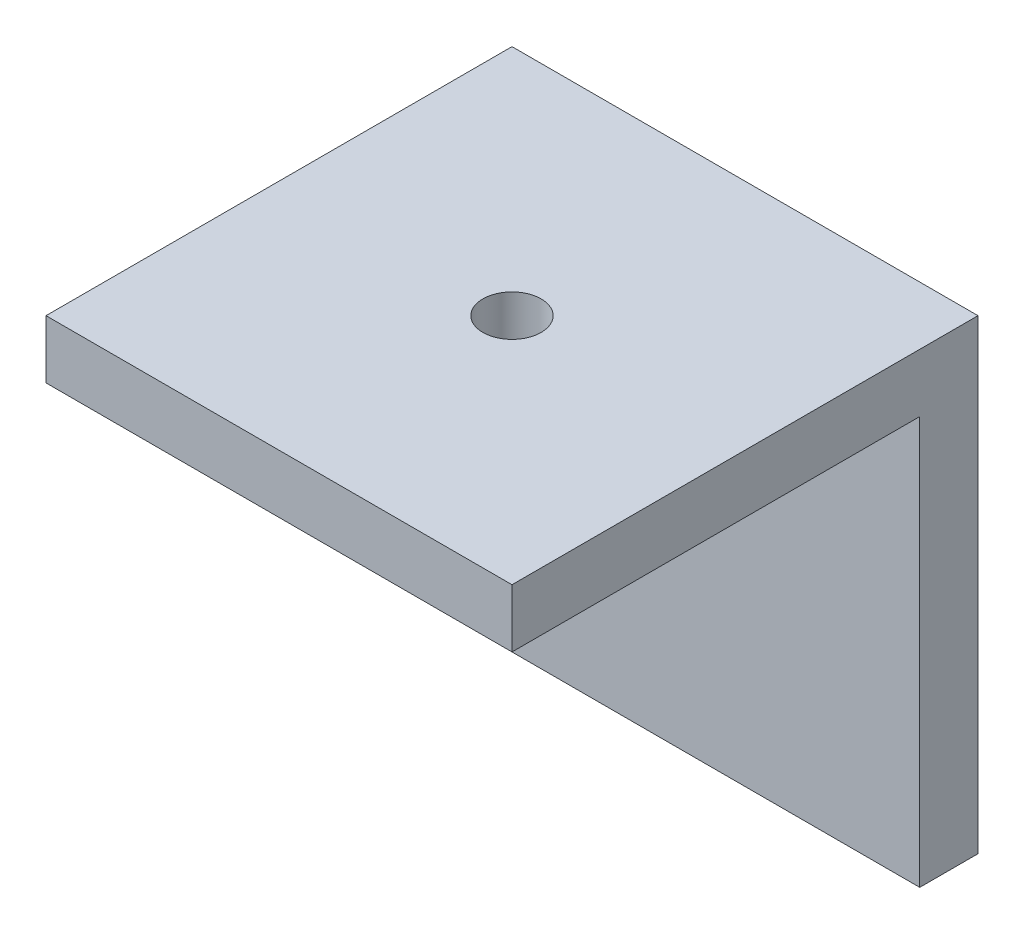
from build123d import *

# Parameters (mm, degrees)
SKETCH_2_W          = 25.4
SKETCH_2_H          = 25.4
SKETCH_2_R          = 1.5875
EXTRUDE_1_DEPTH     = 3.175
SKETCH_3_W          = 25.4
SKETCH_3_H          = 3.175
EXTRUDE_2_DEPTH     = 22.225
SKETCH_4_R          = 1.5875
CUT_EXTRUDE_1_DEPTH = 22.225


with BuildPart() as part:
    # Sketch 2 → Extrude 1 (new body)
    with BuildSketch(Plane.XY):
        Rectangle(SKETCH_2_W, SKETCH_2_H)
        Circle(SKETCH_2_R, mode=Mode.SUBTRACT)
    extrude(amount=EXTRUDE_1_DEPTH)

    # Sketch 3 → Extrude 2 (add)
    with BuildSketch(Plane.XY.offset(3.175)):
        with Locations((0, 11.1125)):
            Rectangle(SKETCH_3_W, SKETCH_3_H)
    extrude(amount=EXTRUDE_2_DEPTH)

    # Sketch 4 → Cut-Extrude 1 (cut)
    with BuildSketch(Plane(origin=(0, 12.7, 0), x_dir=(1, 0, 0), z_dir=(0, 1, 0))):
        with Locations(Location((0, -12.7, 0), (0, 0, 270))):
            Circle(SKETCH_4_R)
    extrude(amount=-CUT_EXTRUDE_1_DEPTH, mode=Mode.SUBTRACT)


solid = part.part
